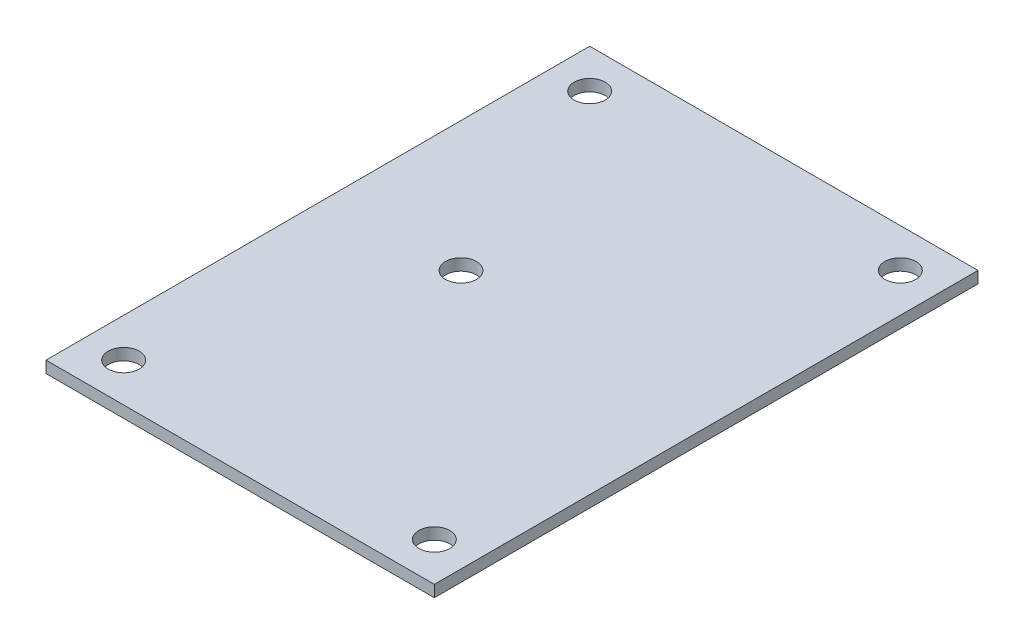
ISO-10303-21;
HEADER;
FILE_DESCRIPTION(('STEP AP214'),'2;1');
FILE_NAME('part.step','',(''),(''),'','','');
FILE_SCHEMA(('AUTOMOTIVE_DESIGN { 1 0 10303 214 1 1 1 1 }'));
ENDSEC;
DATA;
#1=APPLICATION_CONTEXT('core data for automotive mechanical design processes');
#2=APPLICATION_PROTOCOL_DEFINITION('international standard','automotive_design',2000,#1);
#3=PRODUCT_CONTEXT('',#1,'mechanical');
#4=PRODUCT('Part','Part','',(#3));
#5=PRODUCT_RELATED_PRODUCT_CATEGORY('part','',(#4));
#6=PRODUCT_DEFINITION_FORMATION('','',#4);
#7=PRODUCT_DEFINITION_CONTEXT('part definition',#1,'design');
#8=PRODUCT_DEFINITION('design','',#6,#7);
#9=PRODUCT_DEFINITION_SHAPE('','',#8);
#10=(LENGTH_UNIT() NAMED_UNIT(*) SI_UNIT(.MILLI.,.METRE.));
#11=(NAMED_UNIT(*) PLANE_ANGLE_UNIT() SI_UNIT($,.RADIAN.));
#12=(NAMED_UNIT(*) SI_UNIT($,.STERADIAN.) SOLID_ANGLE_UNIT());
#13=UNCERTAINTY_MEASURE_WITH_UNIT(LENGTH_MEASURE(1.E-05),#10,'distance_accuracy_value','');
#14=(GEOMETRIC_REPRESENTATION_CONTEXT(3) GLOBAL_UNCERTAINTY_ASSIGNED_CONTEXT((#13)) GLOBAL_UNIT_ASSIGNED_CONTEXT((#10,
#11,#12)) REPRESENTATION_CONTEXT('',''));
#15=CARTESIAN_POINT('',(0.,0.,0.));
#16=DIRECTION('',(0.,0.,1.));
#17=DIRECTION('',(1.,0.,0.));
#18=AXIS2_PLACEMENT_3D('',#15,#16,#17);
#19=CARTESIAN_POINT('',(25.,1.5,35.));
#20=DIRECTION('',(0.,1.,0.));
#21=DIRECTION('',(0.,0.,1.));
#22=AXIS2_PLACEMENT_3D('',#19,#20,#21);
#23=PLANE('',#22);
#24=CARTESIAN_POINT('',(-8.28427124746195,1.5,-1.71572875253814));
#25=DIRECTION('',(0.,1.,0.));
#26=DIRECTION('',(0.,0.,1.));
#27=AXIS2_PLACEMENT_3D('',#24,#25,#26);
#28=CIRCLE('',#27,2.);
#29=CARTESIAN_POINT('',(-8.28427124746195,1.5,0.284271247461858));
#30=VERTEX_POINT('',#29);
#31=EDGE_CURVE('E135',#30,#30,#28,.T.);
#32=ORIENTED_EDGE('',*,*,#31,.F.);
#33=EDGE_LOOP('',(#32));
#34=FACE_BOUND('',#33,.T.);
#35=CARTESIAN_POINT('',(-20.,1.5,30.));
#36=DIRECTION('',(0.,1.,0.));
#37=DIRECTION('',(0.,0.,1.));
#38=AXIS2_PLACEMENT_3D('',#35,#36,#37);
#39=CIRCLE('',#38,2.);
#40=CARTESIAN_POINT('',(-20.,1.5,32.));
#41=VERTEX_POINT('',#40);
#42=EDGE_CURVE('E121',#41,#41,#39,.T.);
#43=ORIENTED_EDGE('',*,*,#42,.F.);
#44=EDGE_LOOP('',(#43));
#45=FACE_BOUND('',#44,.T.);
#46=CARTESIAN_POINT('',(20.,1.5,-30.));
#47=DIRECTION('',(0.,1.,0.));
#48=DIRECTION('',(0.,0.,1.));
#49=AXIS2_PLACEMENT_3D('',#46,#47,#48);
#50=CIRCLE('',#49,2.);
#51=CARTESIAN_POINT('',(20.,1.5,-28.));
#52=VERTEX_POINT('',#51);
#53=EDGE_CURVE('E100',#52,#52,#50,.T.);
#54=ORIENTED_EDGE('',*,*,#53,.F.);
#55=EDGE_LOOP('',(#54));
#56=FACE_BOUND('',#55,.T.);
#57=DIRECTION('',(0.,0.,-1.));
#58=VECTOR('',#57,1.);
#59=CARTESIAN_POINT('',(25.,1.5,-35.));
#60=LINE('',#59,#58);
#61=CARTESIAN_POINT('',(25.,1.5,35.));
#62=VERTEX_POINT('',#61);
#63=CARTESIAN_POINT('',(25.,1.5,-35.));
#64=VERTEX_POINT('',#63);
#65=EDGE_CURVE('E84',#62,#64,#60,.T.);
#66=ORIENTED_EDGE('',*,*,#65,.T.);
#67=DIRECTION('',(-1.,0.,0.));
#68=VECTOR('',#67,1.);
#69=CARTESIAN_POINT('',(-25.,1.5,-35.));
#70=LINE('',#69,#68);
#71=CARTESIAN_POINT('',(-25.,1.5,-35.));
#72=VERTEX_POINT('',#71);
#73=EDGE_CURVE('E79',#64,#72,#70,.T.);
#74=ORIENTED_EDGE('',*,*,#73,.T.);
#75=DIRECTION('',(0.,0.,1.));
#76=VECTOR('',#75,1.);
#77=CARTESIAN_POINT('',(-25.,1.5,-35.));
#78=LINE('',#77,#76);
#79=CARTESIAN_POINT('',(-25.,1.5,35.));
#80=VERTEX_POINT('',#79);
#81=EDGE_CURVE('E82',#72,#80,#78,.T.);
#82=ORIENTED_EDGE('',*,*,#81,.T.);
#83=DIRECTION('',(1.,0.,0.));
#84=VECTOR('',#83,1.);
#85=CARTESIAN_POINT('',(-25.,1.5,35.));
#86=LINE('',#85,#84);
#87=EDGE_CURVE('E49',#80,#62,#86,.T.);
#88=ORIENTED_EDGE('',*,*,#87,.T.);
#89=EDGE_LOOP('',(#66,#74,#82,#88));
#90=FACE_BOUND('',#89,.T.);
#91=CARTESIAN_POINT('',(-20.,1.5,-30.));
#92=DIRECTION('',(0.,1.,0.));
#93=DIRECTION('',(0.,0.,-1.));
#94=AXIS2_PLACEMENT_3D('',#91,#92,#93);
#95=CIRCLE('',#94,2.);
#96=CARTESIAN_POINT('',(-20.,1.5,-32.));
#97=VERTEX_POINT('',#96);
#98=EDGE_CURVE('E115',#97,#97,#95,.T.);
#99=ORIENTED_EDGE('',*,*,#98,.F.);
#100=EDGE_LOOP('',(#99));
#101=FACE_BOUND('',#100,.T.);
#102=CARTESIAN_POINT('',(20.,1.5,30.));
#103=DIRECTION('',(0.,1.,0.));
#104=DIRECTION('',(0.,0.,-1.));
#105=AXIS2_PLACEMENT_3D('',#102,#103,#104);
#106=CIRCLE('',#105,2.);
#107=CARTESIAN_POINT('',(20.,1.5,28.));
#108=VERTEX_POINT('',#107);
#109=EDGE_CURVE('E127',#108,#108,#106,.T.);
#110=ORIENTED_EDGE('',*,*,#109,.F.);
#111=EDGE_LOOP('',(#110));
#112=FACE_BOUND('',#111,.T.);
#113=ADVANCED_FACE('F31',(#34,#45,#56,#90,#101,#112),#23,.T.);
#114=CARTESIAN_POINT('',(25.,0.,35.));
#115=DIRECTION('',(0.,1.,0.));
#116=DIRECTION('',(0.,0.,1.));
#117=AXIS2_PLACEMENT_3D('',#114,#115,#116);
#118=PLANE('',#117);
#119=CARTESIAN_POINT('',(-8.28427124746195,0.,-1.71572875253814));
#120=DIRECTION('',(0.,1.,0.));
#121=DIRECTION('',(0.,0.,1.));
#122=AXIS2_PLACEMENT_3D('',#119,#120,#121);
#123=CIRCLE('',#122,2.);
#124=CARTESIAN_POINT('',(-8.28427124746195,0.,0.284271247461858));
#125=VERTEX_POINT('',#124);
#126=EDGE_CURVE('E35',#125,#125,#123,.T.);
#127=ORIENTED_EDGE('',*,*,#126,.T.);
#128=EDGE_LOOP('',(#127));
#129=FACE_BOUND('',#128,.T.);
#130=CARTESIAN_POINT('',(-20.,0.,30.));
#131=DIRECTION('',(0.,1.,0.));
#132=DIRECTION('',(0.,0.,1.));
#133=AXIS2_PLACEMENT_3D('',#130,#131,#132);
#134=CIRCLE('',#133,2.);
#135=CARTESIAN_POINT('',(-20.,0.,32.));
#136=VERTEX_POINT('',#135);
#137=EDGE_CURVE('E124',#136,#136,#134,.T.);
#138=ORIENTED_EDGE('',*,*,#137,.T.);
#139=EDGE_LOOP('',(#138));
#140=FACE_BOUND('',#139,.T.);
#141=CARTESIAN_POINT('',(20.,0.,-30.));
#142=DIRECTION('',(0.,1.,0.));
#143=DIRECTION('',(0.,0.,1.));
#144=AXIS2_PLACEMENT_3D('',#141,#142,#143);
#145=CIRCLE('',#144,2.);
#146=CARTESIAN_POINT('',(20.,0.,-28.));
#147=VERTEX_POINT('',#146);
#148=EDGE_CURVE('E112',#147,#147,#145,.T.);
#149=ORIENTED_EDGE('',*,*,#148,.T.);
#150=EDGE_LOOP('',(#149));
#151=FACE_BOUND('',#150,.T.);
#152=DIRECTION('',(0.,0.,-1.));
#153=VECTOR('',#152,1.);
#154=CARTESIAN_POINT('',(25.,0.,-35.));
#155=LINE('',#154,#153);
#156=CARTESIAN_POINT('',(25.,0.,35.));
#157=VERTEX_POINT('',#156);
#158=CARTESIAN_POINT('',(25.,0.,-35.));
#159=VERTEX_POINT('',#158);
#160=EDGE_CURVE('E97',#157,#159,#155,.T.);
#161=ORIENTED_EDGE('',*,*,#160,.F.);
#162=DIRECTION('',(1.,0.,0.));
#163=VECTOR('',#162,1.);
#164=CARTESIAN_POINT('',(-25.,0.,35.));
#165=LINE('',#164,#163);
#166=CARTESIAN_POINT('',(-25.,0.,35.));
#167=VERTEX_POINT('',#166);
#168=EDGE_CURVE('E72',#167,#157,#165,.T.);
#169=ORIENTED_EDGE('',*,*,#168,.F.);
#170=DIRECTION('',(0.,0.,1.));
#171=VECTOR('',#170,1.);
#172=CARTESIAN_POINT('',(-25.,0.,-35.));
#173=LINE('',#172,#171);
#174=CARTESIAN_POINT('',(-25.,0.,-35.));
#175=VERTEX_POINT('',#174);
#176=EDGE_CURVE('E66',#175,#167,#173,.T.);
#177=ORIENTED_EDGE('',*,*,#176,.F.);
#178=DIRECTION('',(-1.,0.,0.));
#179=VECTOR('',#178,1.);
#180=CARTESIAN_POINT('',(-25.,0.,-35.));
#181=LINE('',#180,#179);
#182=EDGE_CURVE('E88',#159,#175,#181,.T.);
#183=ORIENTED_EDGE('',*,*,#182,.F.);
#184=EDGE_LOOP('',(#161,#169,#177,#183));
#185=FACE_BOUND('',#184,.T.);
#186=CARTESIAN_POINT('',(-20.,0.,-30.));
#187=DIRECTION('',(0.,1.,0.));
#188=DIRECTION('',(0.,0.,-1.));
#189=AXIS2_PLACEMENT_3D('',#186,#187,#188);
#190=CIRCLE('',#189,2.);
#191=CARTESIAN_POINT('',(-20.,0.,-32.));
#192=VERTEX_POINT('',#191);
#193=EDGE_CURVE('E118',#192,#192,#190,.T.);
#194=ORIENTED_EDGE('',*,*,#193,.T.);
#195=EDGE_LOOP('',(#194));
#196=FACE_BOUND('',#195,.T.);
#197=CARTESIAN_POINT('',(20.,0.,30.));
#198=DIRECTION('',(0.,1.,0.));
#199=DIRECTION('',(0.,0.,-1.));
#200=AXIS2_PLACEMENT_3D('',#197,#198,#199);
#201=CIRCLE('',#200,2.);
#202=CARTESIAN_POINT('',(20.,0.,28.));
#203=VERTEX_POINT('',#202);
#204=EDGE_CURVE('E130',#203,#203,#201,.T.);
#205=ORIENTED_EDGE('',*,*,#204,.T.);
#206=EDGE_LOOP('',(#205));
#207=FACE_BOUND('',#206,.T.);
#208=ADVANCED_FACE('F108',(#129,#140,#151,#185,#196,#207),#118,.F.);
#209=CARTESIAN_POINT('',(25.,1.5,-35.));
#210=DIRECTION('',(-1.,0.,0.));
#211=DIRECTION('',(0.,0.,1.));
#212=AXIS2_PLACEMENT_3D('',#209,#210,#211);
#213=PLANE('',#212);
#214=ORIENTED_EDGE('',*,*,#160,.T.);
#215=DIRECTION('',(0.,-1.,0.));
#216=VECTOR('',#215,1.);
#217=CARTESIAN_POINT('',(25.,1.5,-35.));
#218=LINE('',#217,#216);
#219=EDGE_CURVE('E11',#64,#159,#218,.T.);
#220=ORIENTED_EDGE('',*,*,#219,.F.);
#221=ORIENTED_EDGE('',*,*,#65,.F.);
#222=DIRECTION('',(0.,-1.,0.));
#223=VECTOR('',#222,1.);
#224=CARTESIAN_POINT('',(25.,1.5,35.));
#225=LINE('',#224,#223);
#226=EDGE_CURVE('E93',#62,#157,#225,.T.);
#227=ORIENTED_EDGE('',*,*,#226,.T.);
#228=EDGE_LOOP('',(#214,#220,#221,#227));
#229=FACE_BOUND('',#228,.T.);
#230=ADVANCED_FACE('F33',(#229),#213,.F.);
#231=CARTESIAN_POINT('',(-25.,1.5,-35.));
#232=DIRECTION('',(0.,0.,1.));
#233=DIRECTION('',(1.,0.,0.));
#234=AXIS2_PLACEMENT_3D('',#231,#232,#233);
#235=PLANE('',#234);
#236=ORIENTED_EDGE('',*,*,#182,.T.);
#237=DIRECTION('',(0.,-1.,0.));
#238=VECTOR('',#237,1.);
#239=CARTESIAN_POINT('',(-25.,1.5,-35.));
#240=LINE('',#239,#238);
#241=EDGE_CURVE('E41',#72,#175,#240,.T.);
#242=ORIENTED_EDGE('',*,*,#241,.F.);
#243=ORIENTED_EDGE('',*,*,#73,.F.);
#244=ORIENTED_EDGE('',*,*,#219,.T.);
#245=EDGE_LOOP('',(#236,#242,#243,#244));
#246=FACE_BOUND('',#245,.T.);
#247=ADVANCED_FACE('F87',(#246),#235,.F.);
#248=CARTESIAN_POINT('',(-25.,1.5,-35.));
#249=DIRECTION('',(1.,0.,0.));
#250=DIRECTION('',(0.,0.,-1.));
#251=AXIS2_PLACEMENT_3D('',#248,#249,#250);
#252=PLANE('',#251);
#253=ORIENTED_EDGE('',*,*,#176,.T.);
#254=DIRECTION('',(0.,-1.,0.));
#255=VECTOR('',#254,1.);
#256=CARTESIAN_POINT('',(-25.,1.5,35.));
#257=LINE('',#256,#255);
#258=EDGE_CURVE('E89',#80,#167,#257,.T.);
#259=ORIENTED_EDGE('',*,*,#258,.F.);
#260=ORIENTED_EDGE('',*,*,#81,.F.);
#261=ORIENTED_EDGE('',*,*,#241,.T.);
#262=EDGE_LOOP('',(#253,#259,#260,#261));
#263=FACE_BOUND('',#262,.T.);
#264=ADVANCED_FACE('F91',(#263),#252,.F.);
#265=CARTESIAN_POINT('',(-25.,1.5,35.));
#266=DIRECTION('',(0.,0.,-1.));
#267=DIRECTION('',(-1.,0.,0.));
#268=AXIS2_PLACEMENT_3D('',#265,#266,#267);
#269=PLANE('',#268);
#270=ORIENTED_EDGE('',*,*,#168,.T.);
#271=ORIENTED_EDGE('',*,*,#226,.F.);
#272=ORIENTED_EDGE('',*,*,#87,.F.);
#273=ORIENTED_EDGE('',*,*,#258,.T.);
#274=EDGE_LOOP('',(#270,#271,#272,#273));
#275=FACE_BOUND('',#274,.T.);
#276=ADVANCED_FACE('F105',(#275),#269,.F.);
#277=CARTESIAN_POINT('',(20.,1.5,-30.));
#278=DIRECTION('',(0.,-1.,0.));
#279=DIRECTION('',(0.,0.,-1.));
#280=AXIS2_PLACEMENT_3D('',#277,#278,#279);
#281=CYLINDRICAL_SURFACE('',#280,2.);
#282=ORIENTED_EDGE('',*,*,#53,.T.);
#283=EDGE_LOOP('',(#282));
#284=FACE_BOUND('',#283,.T.);
#285=ORIENTED_EDGE('',*,*,#148,.F.);
#286=EDGE_LOOP('',(#285));
#287=FACE_BOUND('',#286,.T.);
#288=ADVANCED_FACE('F163',(#284,#287),#281,.F.);
#289=CARTESIAN_POINT('',(-20.,1.5,-30.));
#290=DIRECTION('',(0.,-1.,0.));
#291=DIRECTION('',(0.,0.,-1.));
#292=AXIS2_PLACEMENT_3D('',#289,#290,#291);
#293=CYLINDRICAL_SURFACE('',#292,2.);
#294=ORIENTED_EDGE('',*,*,#98,.T.);
#295=EDGE_LOOP('',(#294));
#296=FACE_BOUND('',#295,.T.);
#297=ORIENTED_EDGE('',*,*,#193,.F.);
#298=EDGE_LOOP('',(#297));
#299=FACE_BOUND('',#298,.T.);
#300=ADVANCED_FACE('F200',(#296,#299),#293,.F.);
#301=CARTESIAN_POINT('',(-20.,1.5,30.));
#302=DIRECTION('',(0.,-1.,0.));
#303=DIRECTION('',(0.,0.,-1.));
#304=AXIS2_PLACEMENT_3D('',#301,#302,#303);
#305=CYLINDRICAL_SURFACE('',#304,2.);
#306=ORIENTED_EDGE('',*,*,#42,.T.);
#307=EDGE_LOOP('',(#306));
#308=FACE_BOUND('',#307,.T.);
#309=ORIENTED_EDGE('',*,*,#137,.F.);
#310=EDGE_LOOP('',(#309));
#311=FACE_BOUND('',#310,.T.);
#312=ADVANCED_FACE('F151',(#308,#311),#305,.F.);
#313=CARTESIAN_POINT('',(20.,1.5,30.));
#314=DIRECTION('',(0.,-1.,0.));
#315=DIRECTION('',(0.,0.,-1.));
#316=AXIS2_PLACEMENT_3D('',#313,#314,#315);
#317=CYLINDRICAL_SURFACE('',#316,2.);
#318=ORIENTED_EDGE('',*,*,#109,.T.);
#319=EDGE_LOOP('',(#318));
#320=FACE_BOUND('',#319,.T.);
#321=ORIENTED_EDGE('',*,*,#204,.F.);
#322=EDGE_LOOP('',(#321));
#323=FACE_BOUND('',#322,.T.);
#324=ADVANCED_FACE('F146',(#320,#323),#317,.F.);
#325=CARTESIAN_POINT('',(-8.28427124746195,-8.5,-1.71572875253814));
#326=DIRECTION('',(0.,1.,0.));
#327=DIRECTION('',(0.,0.,1.));
#328=AXIS2_PLACEMENT_3D('',#325,#326,#327);
#329=CYLINDRICAL_SURFACE('',#328,2.);
#330=ORIENTED_EDGE('',*,*,#31,.T.);
#331=EDGE_LOOP('',(#330));
#332=FACE_BOUND('',#331,.T.);
#333=ORIENTED_EDGE('',*,*,#126,.F.);
#334=EDGE_LOOP('',(#333));
#335=FACE_BOUND('',#334,.T.);
#336=ADVANCED_FACE('F144',(#332,#335),#329,.F.);
#337=CLOSED_SHELL('',(#113,#208,#230,#247,#264,#276,#288,#300,#312,#324,#336));
#338=MANIFOLD_SOLID_BREP('B2',#337);
#339=ADVANCED_BREP_SHAPE_REPRESENTATION('',(#18,#338),#14);
#340=SHAPE_DEFINITION_REPRESENTATION(#9,#339);
ENDSEC;
END-ISO-10303-21;
